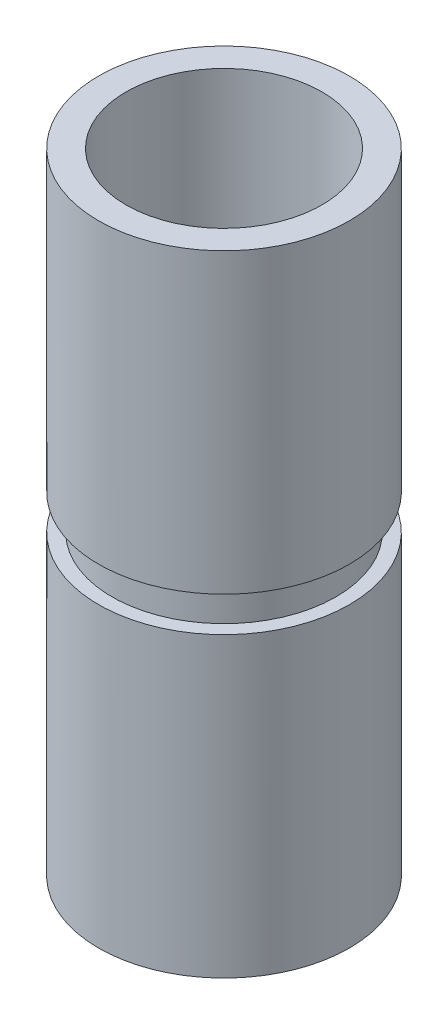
from build123d import *

# Parameters (mm, degrees)
SKETCH1_R           = 22.7584
SKETCH1_R_2         = 17.78
BOSS_EXTRUDE4_DEPTH = 114.3
SKETCH17_R          = 22.86
SKETCH17_R_2        = 20.32
CUT_EXTRUDE3_DEPTH  = 3.175


with BuildPart() as part:
    # Sketch1 → Boss-Extrude4 (new body)
    with BuildSketch(Plane(origin=(0, 0, 0), x_dir=(1, 0, 0), z_dir=(0, 1, 0))):
        with Locations(Location((0, 0, 0), (0, 0, 270))):
            Circle(SKETCH1_R)
        with Locations(Location((0, 0, 0), (0, 0, 270))):
            Circle(SKETCH1_R_2, mode=Mode.SUBTRACT)
    extrude(amount=BOSS_EXTRUDE4_DEPTH)

    # Sketch17 → Cut-Extrude3 (cut, symmetric)
    with BuildSketch(Plane(origin=(0, 57.15, 0), x_dir=(-1, 0, 0), z_dir=(0, -1, 0))):
        Circle(SKETCH17_R)
        with Locations(Location((0, 0, 0), (0, 0, 180))):
            Circle(SKETCH17_R_2, mode=Mode.SUBTRACT)
    extrude(amount=CUT_EXTRUDE3_DEPTH, both=True, mode=Mode.SUBTRACT)


solid = part.part
